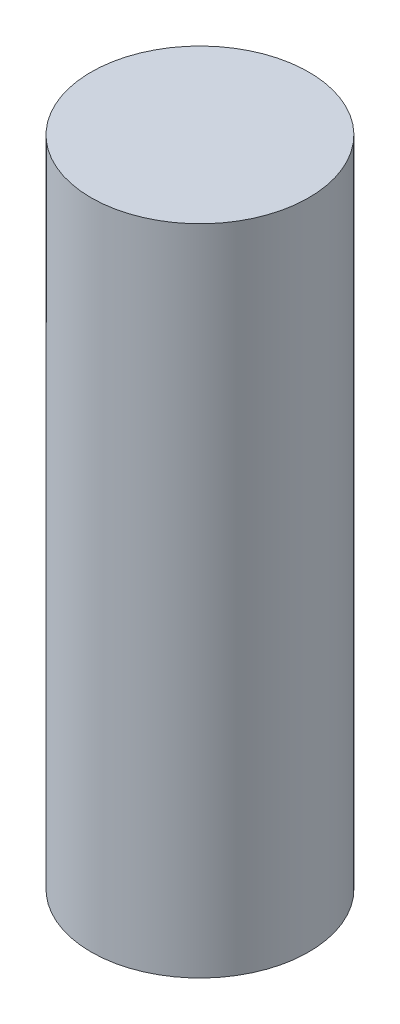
from build123d import *

# Parameters (mm, degrees)
CROQUIS1_R              = 2.5
SALIENTE_EXTRUIR1_DEPTH = 7.5


with BuildPart() as part:
    # Croquis1 → Saliente-Extruir1 (new, symmetric)
    with BuildSketch(Plane(origin=(0, 0, 0), x_dir=(1, 0, 0), z_dir=(0, 1, 0))):
        with Locations(Location((0, 0, 0), (0, 0, 270))):
            Circle(CROQUIS1_R)
    extrude(amount=SALIENTE_EXTRUIR1_DEPTH, both=True)


solid = part.part
